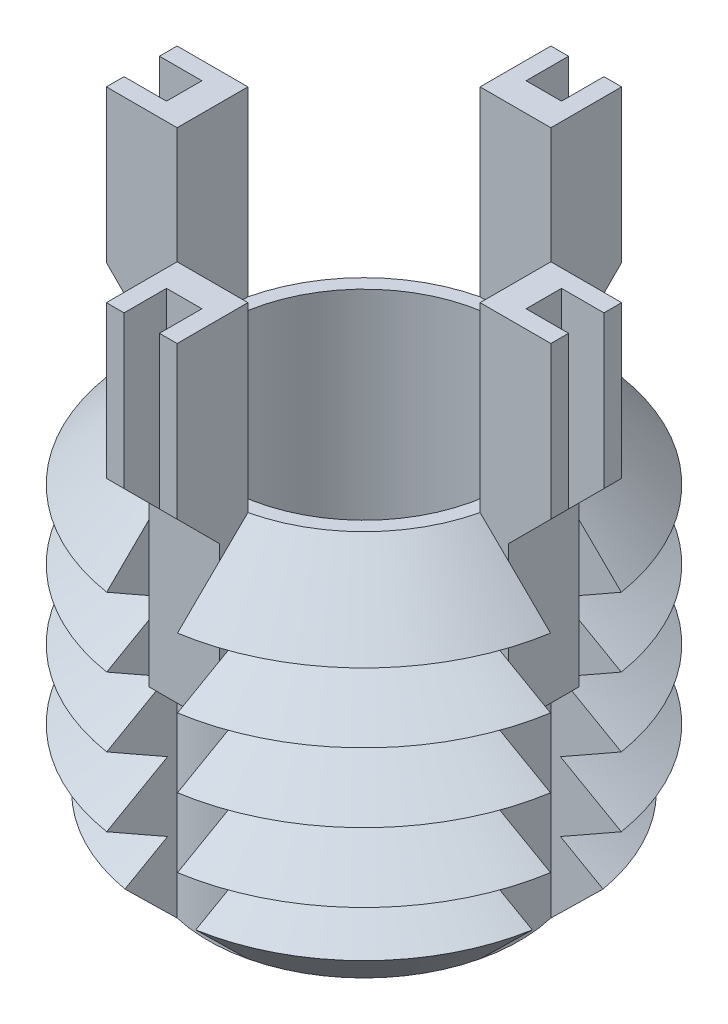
from build123d import *

# Parameters (mm, degrees)
SKETCH1_R           = 6.35
BOSS_EXTRUDE1_DEPTH = 10.922
CHAMFER1_SIZE       = 1.954
LPATTERN1_COUNT     = 4
LPATTERN1_PITCH     = 1.954
CUT_EXTRUDE1_REACH  = 16.14
CIRPATTERN1_COUNT   = 4
BOSS_EXTRUDE3_DEPTH = 1
CIRPATTERN2_COUNT   = 4
CUT_EXTRUDE3_REACH  = 20.353
SKETCH6_W           = 1.2
SKETCH6_H           = 1
SKETCH6_W_2         = 1
SKETCH6_H_2         = 1.2
SKETCH7_R           = 4
CUT_EXTRUDE4_DEPTH  = 10.922


with BuildPart() as part:
    # Sketch1 → Boss-Extrude1 (new body)
    with BuildSketch(Plane(origin=(0, 0, 0), x_dir=(1, 0, 0), z_dir=(0, 1, 0))):
        with Locations(Location((0, 0, 0), (0, 0, 270))):
            Circle(SKETCH1_R)
    extrude(amount=-BOSS_EXTRUDE1_DEPTH)

    # Chamfer1
    chamfer1_edges = [part.edges().sort_by_distance(p)[0] for p in [
        (0, 0, -6.35),
        (0, -10.922, -6.35),
    ]]
    chamfer(chamfer1_edges, length=CHAMFER1_SIZE)

    # Sketch3 → Cut-Revolve1 (revolve, cut)
    with BuildSketch(Plane(origin=(0, 0, 0), x_dir=(0, 0, -1), z_dir=(1, 0, 0))):
        Polygon((-6.35, -1.954), (-4.657786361, -2.931), (-6.35, -3.908), align=None)
    cut_revolve1 = revolve(axis=Axis((0, 0.885892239, 0), (0, -1, 0)), mode=Mode.SUBTRACT)

    # LPattern1: Cut-Revolve1 ×4
    with Locations(*[(0, -i * LPATTERN1_PITCH, 0) for i in range(1, LPATTERN1_COUNT)]):
        add(cut_revolve1, mode=Mode.SUBTRACT)

    # Cut-Extrude1: up to this cone (the profile starts inside it)
    cut_extrude1_end = Plane(origin=(0, 0, 0), z_dir=(0, 1, 0)).offset(-15.317999) * Cone(1e-06, 47.276, 47.275999, align=(Align.CENTER, Align.CENTER, Align.MIN), mode=Mode.PRIVATE)
    # Sketch4 → Cut-Extrude1 (cut, up to the surface)
    with BuildSketch(Plane(origin=(0, 0, 0), x_dir=(1, 0, 0), z_dir=(0, 1, 0)), mode=Mode.PRIVATE) as cut_extrude1_sk1:
        with BuildLine():
            Line((-4.280749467, 1), (-6.270765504, 1))
            ThreePointArc((-6.270765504, 1), (-6.35, 0), (-6.270765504, -1))
            Line((-6.270765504, -1), (-4.280749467, -1))
            ThreePointArc((-4.280749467, -1), (-4.396, 0), (-4.280749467, 1))
        make_face()
    cut_extrude1_tool1 = extrude(cut_extrude1_sk1.sketch, amount=-CUT_EXTRUDE1_REACH, mode=Mode.PRIVATE) & cut_extrude1_end
    cut_extrude1 = cut_extrude1_tool1.solids().sort_by_distance((-5.340563, 0, 0))[0]
    add(cut_extrude1, mode=Mode.SUBTRACT)

    # CirPattern1: Cut-Extrude1 ×4 about axis
    cirpattern1_axis = Axis((0, 0, 0), (0, 1, 0))
    for i in range(1, CIRPATTERN1_COUNT):
        add(cut_extrude1.rotate(cirpattern1_axis, i * 360 / CIRPATTERN1_COUNT), mode=Mode.SUBTRACT)

    # Sketch5 → Boss-Extrude3 (add, symmetric)
    with BuildSketch(Plane(origin=(0, 0, 0), x_dir=(0, 0, -1), z_dir=(1, 0, 0))):
        Polygon((-4.280749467, 5.138), (-4.280749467, -4.862), (-5.080749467, -4.862), (-5.080749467, -0.362), (-6.280749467, 0.838), (-6.280749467, 5.138), align=None)
    boss_extrude3 = extrude(amount=BOSS_EXTRUDE3_DEPTH, both=True)

    # CirPattern2: Boss-Extrude3 ×4 about axis
    cirpattern2_axis = Axis((0, 0, 0), (0, 1, 0))
    for i in range(1, CIRPATTERN2_COUNT):
        add(boss_extrude3.rotate(cirpattern2_axis, i * 360 / CIRPATTERN2_COUNT))

    # Cut-Extrude3: up to this plane
    cut_extrude3_end = Plane(origin=(-5.080749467, -0.362, 1), z_dir=(0.7071067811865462, 0.707106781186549, -7.406550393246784e-15))
    # Sketch6 → Cut-Extrude3 (cut, up to the surface)
    with BuildSketch(Plane(origin=(0, 5.138, 0), x_dir=(1, 0, 0), z_dir=(0, 1, 0)), mode=Mode.PRIVATE) as cut_extrude3_sk1:
        with Locations((-5.680749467, 0)):
            Rectangle(SKETCH6_W, SKETCH6_H)
    cut_extrude3_tool1 = split(extrude(cut_extrude3_sk1.sketch, amount=-CUT_EXTRUDE3_REACH, mode=Mode.PRIVATE), bisect_by=cut_extrude3_end, keep=Keep.BOTH, mode=Mode.PRIVATE)
    add(cut_extrude3_tool1.solids().sort_by_distance((-5.680749, 5.138, 0))[0], mode=Mode.SUBTRACT)
    # Sketch6 → Cut-Extrude3 (cut, up to the surface)
    with BuildSketch(Plane(origin=(0, 5.138, 0), x_dir=(1, 0, 0), z_dir=(0, 1, 0)), mode=Mode.PRIVATE) as cut_extrude3_sk2:
        with Locations((0, 5.680749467)):
            Rectangle(SKETCH6_W_2, SKETCH6_H_2)
    cut_extrude3_tool2 = split(extrude(cut_extrude3_sk2.sketch, amount=-CUT_EXTRUDE3_REACH, mode=Mode.PRIVATE), bisect_by=cut_extrude3_end, keep=Keep.BOTH, mode=Mode.PRIVATE)
    add(cut_extrude3_tool2.solids().sort_by_distance((0, 5.138, -5.680749))[0], mode=Mode.SUBTRACT)
    # Sketch6 → Cut-Extrude3 (cut, up to the surface)
    with BuildSketch(Plane(origin=(0, 5.138, 0), x_dir=(1, 0, 0), z_dir=(0, 1, 0)), mode=Mode.PRIVATE) as cut_extrude3_sk3:
        with Locations((5.680749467, 0)):
            Rectangle(SKETCH6_W, SKETCH6_H)
    cut_extrude3_tool3 = split(extrude(cut_extrude3_sk3.sketch, amount=-CUT_EXTRUDE3_REACH, mode=Mode.PRIVATE), bisect_by=cut_extrude3_end, keep=Keep.BOTH, mode=Mode.PRIVATE)
    add(cut_extrude3_tool3.solids().sort_by_distance((5.680749, 5.138, 0))[0], mode=Mode.SUBTRACT)
    # Sketch6 → Cut-Extrude3 (cut, up to the surface)
    with BuildSketch(Plane(origin=(0, 5.138, 0), x_dir=(1, 0, 0), z_dir=(0, 1, 0)), mode=Mode.PRIVATE) as cut_extrude3_sk4:
        with Locations((0, -5.680749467)):
            Rectangle(SKETCH6_W_2, SKETCH6_H_2)
    cut_extrude3_tool4 = split(extrude(cut_extrude3_sk4.sketch, amount=-CUT_EXTRUDE3_REACH, mode=Mode.PRIVATE), bisect_by=cut_extrude3_end, keep=Keep.BOTH, mode=Mode.PRIVATE)
    add(cut_extrude3_tool4.solids().sort_by_distance((0, 5.138, 5.680749))[0], mode=Mode.SUBTRACT)

    # Sketch7 → Cut-Extrude4 (cut)
    with BuildSketch(Plane(origin=(0, 0, 0), x_dir=(1, 0, 0), z_dir=(0, 1, 0))):
        with Locations(Location((0, 0, 0), (0, 0, 270))):
            Circle(SKETCH7_R)
    extrude(amount=-CUT_EXTRUDE4_DEPTH, mode=Mode.SUBTRACT)


solid = part.part
